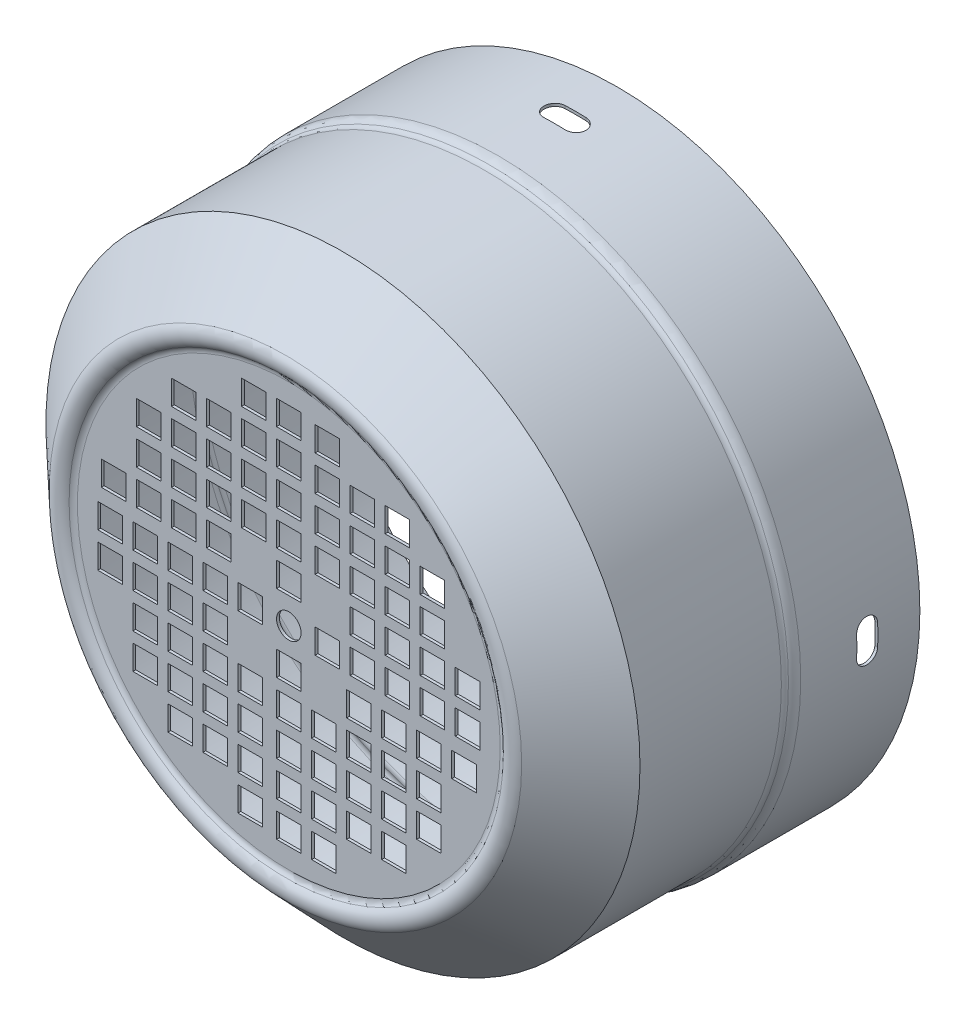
from build123d import *

# Parameters (mm, degrees)
SKETCH_2_R               = 3.5
SKETCH_2_W               = 7
SKETCH_2_H               = 7
CUT_EXTRUDE_1_DEPTH      = 10
CUT_EXTRUDE_2_DEPTH      = 155.658059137
PATTERN_CIRCULAR_1_COUNT = 4


with BuildPart() as part:
    # Sketch 1 → Revolve 2 (revolve)
    with BuildSketch(Plane(origin=(0, 0, 0), x_dir=(1, 0, 0), z_dir=(0, 1, 0))):
        with BuildLine():
            Line((85.496336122, 95), (85.496336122, 61))
            ThreePointArc((85.496336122, 61), (85.298853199, 59.929533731), (84.732404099, 59))
            ThreePointArc((84.732404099, 59), (84.165955, 58.070466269), (83.968472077, 57))
            Line((83.968472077, 57), (83.968472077, 56.873397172))
            Line((83.968472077, 56.873397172), (83.968472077, 17))
            Line((83.968472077, 17), (66.867522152, 0.820764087))
            ThreePointArc((66.867522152, 0.820764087), (64.680741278, 0.002605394), (62.569675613, 1))
            ThreePointArc((62.569675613, 1), (61.558352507, 1.738612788), (60.333607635, 2))
            Line((60.333607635, 2), (0, 2))
            Line((0, 2), (0, 1.2))
            Line((0, 1.2), (60.333607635, 1.2))
            ThreePointArc((60.333607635, 1.2), (61.231753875, 1.008316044), (61.973390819, 0.466666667))
            ThreePointArc((61.973390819, 0.466666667), (64.647407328, -0.796699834), (67.417329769, 0.239634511))
            Line((67.417329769, 0.239634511), (84.768472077, 16.655577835))
            Line((84.768472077, 16.655577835), (84.768472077, 56.873397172))
            Line((84.768472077, 56.873397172), (84.768472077, 57))
            ThreePointArc((84.768472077, 57), (84.913292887, 57.785008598), (85.328688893, 58.466666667))
            ThreePointArc((85.328688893, 58.466666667), (86.046191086, 59.644076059), (86.296336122, 61))
            Line((86.296336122, 61), (86.296336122, 95))
            Line((86.296336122, 95), (85.496336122, 95))
        make_face()
    revolve(axis=Axis((0, 0, 0), (0, 0, -1)))

    # Sketch 2 → Cut-Extrude 1 (cut)
    with BuildSketch(Plane.XY.offset(-1.2)):
        Circle(SKETCH_2_R)
        with Locations((11, 0)):
            Rectangle(SKETCH_2_W, SKETCH_2_H)
        with Locations((21, 0)):
            Rectangle(SKETCH_2_W, SKETCH_2_H)
        with Locations((31, 0)):
            Rectangle(SKETCH_2_W, SKETCH_2_H)
        with Locations((41, 0)):
            Rectangle(SKETCH_2_W, SKETCH_2_H)
        with Locations((51, 0)):
            Rectangle(SKETCH_2_W, SKETCH_2_H)
        with Locations((11, 20)):
            Rectangle(SKETCH_2_W, SKETCH_2_H)
        with Locations((11, 30)):
            Rectangle(SKETCH_2_W, SKETCH_2_H)
        with Locations((11, 40)):
            Rectangle(SKETCH_2_W, SKETCH_2_H)
        with Locations((11, 50)):
            Rectangle(SKETCH_2_W, SKETCH_2_H)
        with Locations((21, 10)):
            Rectangle(SKETCH_2_W, SKETCH_2_H)
        with Locations((31, 10)):
            Rectangle(SKETCH_2_W, SKETCH_2_H)
        with Locations((41, 10)):
            Rectangle(SKETCH_2_W, SKETCH_2_H)
        with Locations((51, 10)):
            Rectangle(SKETCH_2_W, SKETCH_2_H)
        with Locations((21, 20)):
            Rectangle(SKETCH_2_W, SKETCH_2_H)
        with Locations((31, 20)):
            Rectangle(SKETCH_2_W, SKETCH_2_H)
        with Locations((41, 20)):
            Rectangle(SKETCH_2_W, SKETCH_2_H)
        with Locations((21, 30)):
            Rectangle(SKETCH_2_W, SKETCH_2_H)
        with Locations((31, 30)):
            Rectangle(SKETCH_2_W, SKETCH_2_H)
        with Locations((41, 30)):
            Rectangle(SKETCH_2_W, SKETCH_2_H)
        with Locations((21, 40)):
            Rectangle(SKETCH_2_W, SKETCH_2_H)
        with Locations((31, 40)):
            Rectangle(SKETCH_2_W, SKETCH_2_H)
        with Locations((0, -11)):
            Rectangle(SKETCH_2_W, SKETCH_2_H)
        with Locations((0, -21)):
            Rectangle(SKETCH_2_W, SKETCH_2_H)
        with Locations((0, -31)):
            Rectangle(SKETCH_2_W, SKETCH_2_H)
        with Locations((0, -41)):
            Rectangle(SKETCH_2_W, SKETCH_2_H)
        with Locations((0, -51)):
            Rectangle(SKETCH_2_W, SKETCH_2_H)
        with Locations((10, -51)):
            Rectangle(SKETCH_2_W, SKETCH_2_H)
        with Locations((10, -41)):
            Rectangle(SKETCH_2_W, SKETCH_2_H)
        with Locations((10, -31)):
            Rectangle(SKETCH_2_W, SKETCH_2_H)
        with Locations((10, -21)):
            Rectangle(SKETCH_2_W, SKETCH_2_H)
        with Locations((20, -11)):
            Rectangle(SKETCH_2_W, SKETCH_2_H)
        with Locations((20, -21)):
            Rectangle(SKETCH_2_W, SKETCH_2_H)
        with Locations((20, -31)):
            Rectangle(SKETCH_2_W, SKETCH_2_H)
        with Locations((20, -41)):
            Rectangle(SKETCH_2_W, SKETCH_2_H)
        with Locations((30, -41)):
            Rectangle(SKETCH_2_W, SKETCH_2_H)
        with Locations((30, -31)):
            Rectangle(SKETCH_2_W, SKETCH_2_H)
        with Locations((30, -21)):
            Rectangle(SKETCH_2_W, SKETCH_2_H)
        with Locations((30, -11)):
            Rectangle(SKETCH_2_W, SKETCH_2_H)
        with Locations((40, -11)):
            Rectangle(SKETCH_2_W, SKETCH_2_H)
        with Locations((40, -21)):
            Rectangle(SKETCH_2_W, SKETCH_2_H)
        with Locations((40, -31)):
            Rectangle(SKETCH_2_W, SKETCH_2_H)
        with Locations((50, -11)):
            Rectangle(SKETCH_2_W, SKETCH_2_H)
        with Locations((-11, 0)):
            Rectangle(SKETCH_2_W, SKETCH_2_H)
        with Locations((-21, 0)):
            Rectangle(SKETCH_2_W, SKETCH_2_H)
        with Locations((-31, 0)):
            Rectangle(SKETCH_2_W, SKETCH_2_H)
        with Locations((-41, 0)):
            Rectangle(SKETCH_2_W, SKETCH_2_H)
        with Locations((-51, 0)):
            Rectangle(SKETCH_2_W, SKETCH_2_H)
        with Locations((-51, -10)):
            Rectangle(SKETCH_2_W, SKETCH_2_H)
        with Locations((-41, -10)):
            Rectangle(SKETCH_2_W, SKETCH_2_H)
        with Locations((-31, -10)):
            Rectangle(SKETCH_2_W, SKETCH_2_H)
        with Locations((-21, -10)):
            Rectangle(SKETCH_2_W, SKETCH_2_H)
        with Locations((-11, -20)):
            Rectangle(SKETCH_2_W, SKETCH_2_H)
        with Locations((-21, -20)):
            Rectangle(SKETCH_2_W, SKETCH_2_H)
        with Locations((-31, -20)):
            Rectangle(SKETCH_2_W, SKETCH_2_H)
        with Locations((-41, -20)):
            Rectangle(SKETCH_2_W, SKETCH_2_H)
        with Locations((-41, -30)):
            Rectangle(SKETCH_2_W, SKETCH_2_H)
        with Locations((-31, -30)):
            Rectangle(SKETCH_2_W, SKETCH_2_H)
        with Locations((-21, -30)):
            Rectangle(SKETCH_2_W, SKETCH_2_H)
        with Locations((-11, -30)):
            Rectangle(SKETCH_2_W, SKETCH_2_H)
        with Locations((-11, -40)):
            Rectangle(SKETCH_2_W, SKETCH_2_H)
        with Locations((-21, -40)):
            Rectangle(SKETCH_2_W, SKETCH_2_H)
        with Locations((-31, -40)):
            Rectangle(SKETCH_2_W, SKETCH_2_H)
        with Locations((-11, -50)):
            Rectangle(SKETCH_2_W, SKETCH_2_H)
        with Locations((0, 11)):
            Rectangle(SKETCH_2_W, SKETCH_2_H)
        with Locations((0, 21)):
            Rectangle(SKETCH_2_W, SKETCH_2_H)
        with Locations((0, 31)):
            Rectangle(SKETCH_2_W, SKETCH_2_H)
        with Locations((0, 41)):
            Rectangle(SKETCH_2_W, SKETCH_2_H)
        with Locations((0, 51)):
            Rectangle(SKETCH_2_W, SKETCH_2_H)
        with Locations((-10, 51)):
            Rectangle(SKETCH_2_W, SKETCH_2_H)
        with Locations((-10, 41)):
            Rectangle(SKETCH_2_W, SKETCH_2_H)
        with Locations((-10, 31)):
            Rectangle(SKETCH_2_W, SKETCH_2_H)
        with Locations((-10, 21)):
            Rectangle(SKETCH_2_W, SKETCH_2_H)
        with Locations((-20, 11)):
            Rectangle(SKETCH_2_W, SKETCH_2_H)
        with Locations((-20, 21)):
            Rectangle(SKETCH_2_W, SKETCH_2_H)
        with Locations((-20, 31)):
            Rectangle(SKETCH_2_W, SKETCH_2_H)
        with Locations((-20, 41)):
            Rectangle(SKETCH_2_W, SKETCH_2_H)
        with Locations((-30, 41)):
            Rectangle(SKETCH_2_W, SKETCH_2_H)
        with Locations((-30, 31)):
            Rectangle(SKETCH_2_W, SKETCH_2_H)
        with Locations((-30, 21)):
            Rectangle(SKETCH_2_W, SKETCH_2_H)
        with Locations((-30, 11)):
            Rectangle(SKETCH_2_W, SKETCH_2_H)
        with Locations((-40, 11)):
            Rectangle(SKETCH_2_W, SKETCH_2_H)
        with Locations((-40, 21)):
            Rectangle(SKETCH_2_W, SKETCH_2_H)
        with Locations((-40, 31)):
            Rectangle(SKETCH_2_W, SKETCH_2_H)
        with Locations((-50, 11)):
            Rectangle(SKETCH_2_W, SKETCH_2_H)
    extrude(amount=-CUT_EXTRUDE_1_DEPTH, mode=Mode.SUBTRACT)

    # Sketch 3 → Cut-Extrude 2 (cut, through all)
    with BuildSketch(Plane(origin=(0, 0, 0), x_dir=(1, 0, 0), z_dir=(0, 1, 0))):
        with BuildLine():
            Line((-3, 83), (3, 83))
            ThreePointArc((3, 83), (6, 80), (3, 77))
            Line((3, 77), (-3, 77))
            ThreePointArc((-3, 77), (-6, 80), (-3, 83))
        make_face()
    cut_extrude_2 = extrude(amount=-CUT_EXTRUDE_2_DEPTH, mode=Mode.SUBTRACT)

    # Pattern Circular 1: Cut-Extrude 2 ×4 about axis
    pattern_circular_1_axis = Axis((0, 0, 0), (0, 0, 1))
    for i in range(1, PATTERN_CIRCULAR_1_COUNT):
        add(cut_extrude_2.rotate(pattern_circular_1_axis, i * 360 / PATTERN_CIRCULAR_1_COUNT), mode=Mode.SUBTRACT)


solid = part.part
